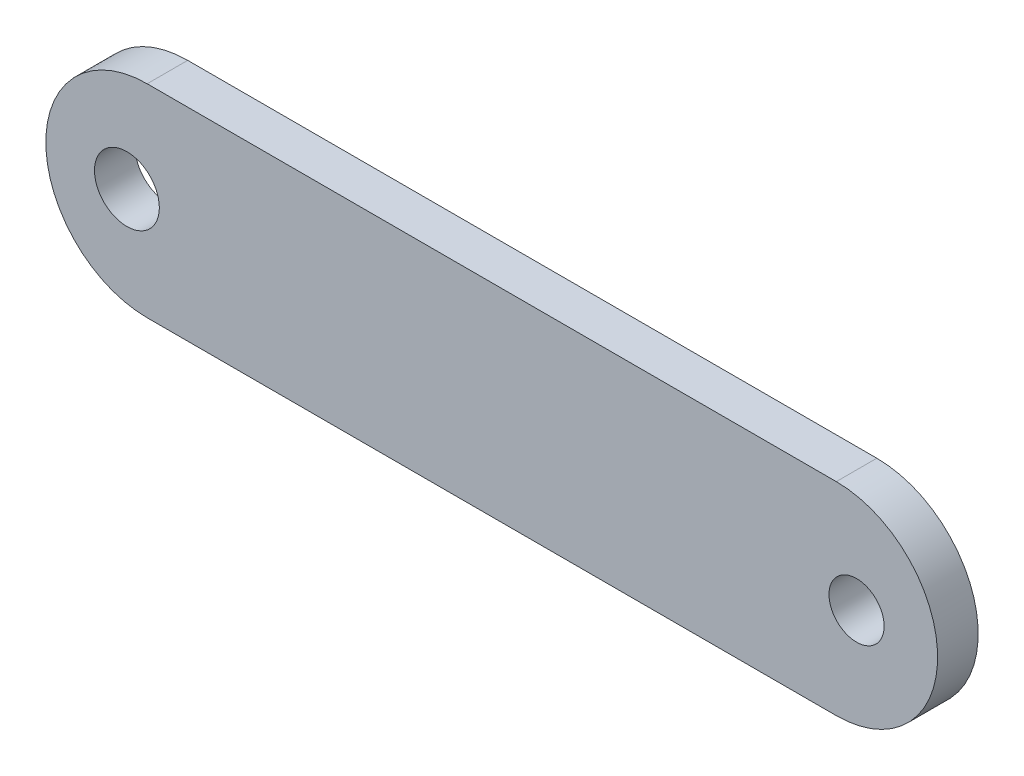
from build123d import *

# Parameters (mm, degrees)
BOSS_EXTRU_1_DEPTH      = 2.5
ESQUISSE2_R             = 4
ENL_V_MAT_EXTRU_1_DEPTH = 57.623758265
TROU_TARAUD_M81_D       = 6.8


with BuildPart() as part:
    # Esquisse1 → Boss.-Extru.1 (new, symmetric)
    with BuildSketch(Plane.XY):
        with BuildLine():
            Line((-42.5, 12.5), (42.5, 12.5))
            ThreePointArc((42.5, 12.5), (55, 0), (42.5, -12.5))
            Line((42.5, -12.5), (-42.5, -12.5))
            ThreePointArc((-42.5, -12.5), (-55, 0), (-42.5, 12.5))
        make_face()
    extrude(amount=BOSS_EXTRU_1_DEPTH, both=True)

    # Esquisse2 → Enl_v. mat.-Extru.1 (cut, through all)
    with BuildSketch(Plane.XY.offset(2.5)):
        with Locations((-45, 0)):
            Circle(ESQUISSE2_R)
    extrude(amount=-ENL_V_MAT_EXTRU_1_DEPTH, mode=Mode.SUBTRACT)

    # Trou taraud_ M81 (through all)
    with Locations(Plane.XY.offset(2.5)):
        with Locations((45, 0)):
            Hole(TROU_TARAUD_M81_D / 2)


solid = part.part
